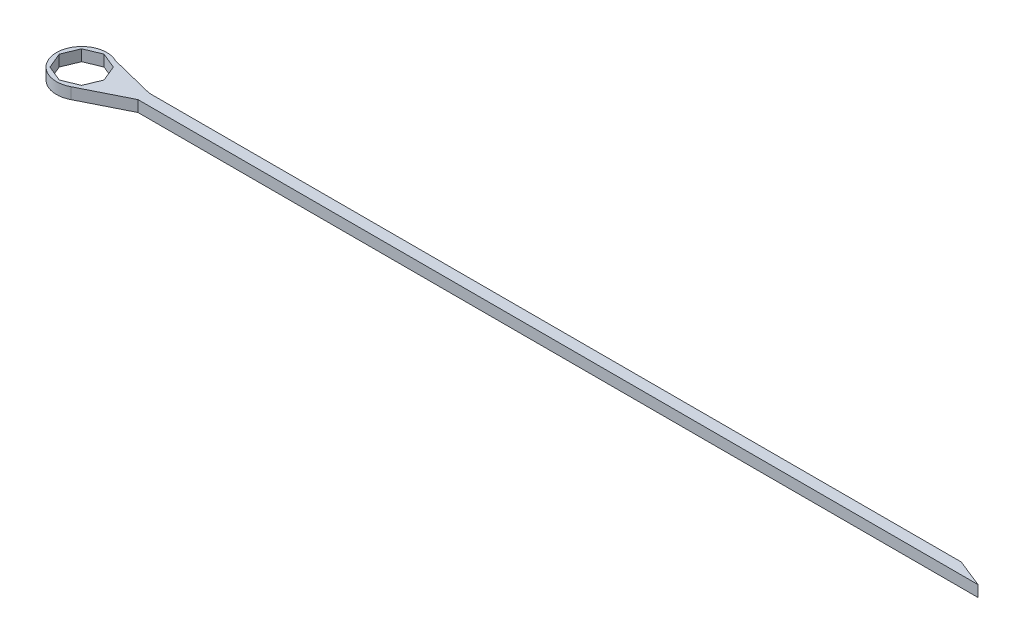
ISO-10303-21;
HEADER;
FILE_DESCRIPTION(('STEP AP214'),'2;1');
FILE_NAME('part.step','',(''),(''),'','','');
FILE_SCHEMA(('AUTOMOTIVE_DESIGN { 1 0 10303 214 1 1 1 1 }'));
ENDSEC;
DATA;
#1=APPLICATION_CONTEXT('core data for automotive mechanical design processes');
#2=APPLICATION_PROTOCOL_DEFINITION('international standard','automotive_design',2000,#1);
#3=PRODUCT_CONTEXT('',#1,'mechanical');
#4=PRODUCT('Part','Part','',(#3));
#5=PRODUCT_RELATED_PRODUCT_CATEGORY('part','',(#4));
#6=PRODUCT_DEFINITION_FORMATION('','',#4);
#7=PRODUCT_DEFINITION_CONTEXT('part definition',#1,'design');
#8=PRODUCT_DEFINITION('design','',#6,#7);
#9=PRODUCT_DEFINITION_SHAPE('','',#8);
#10=(LENGTH_UNIT() NAMED_UNIT(*) SI_UNIT(.MILLI.,.METRE.));
#11=(NAMED_UNIT(*) PLANE_ANGLE_UNIT() SI_UNIT($,.RADIAN.));
#12=(NAMED_UNIT(*) SI_UNIT($,.STERADIAN.) SOLID_ANGLE_UNIT());
#13=UNCERTAINTY_MEASURE_WITH_UNIT(LENGTH_MEASURE(1.E-05),#10,'distance_accuracy_value','');
#14=(GEOMETRIC_REPRESENTATION_CONTEXT(3) GLOBAL_UNCERTAINTY_ASSIGNED_CONTEXT((#13)) GLOBAL_UNIT_ASSIGNED_CONTEXT((#10,
#11,#12)) REPRESENTATION_CONTEXT('',''));
#15=CARTESIAN_POINT('',(0.,0.,0.));
#16=DIRECTION('',(0.,0.,1.));
#17=DIRECTION('',(1.,0.,0.));
#18=AXIS2_PLACEMENT_3D('',#15,#16,#17);
#19=CARTESIAN_POINT('',(0.,1.,0.));
#20=DIRECTION('',(0.,1.,0.));
#21=DIRECTION('',(0.,0.,1.));
#22=AXIS2_PLACEMENT_3D('',#19,#20,#21);
#23=PLANE('',#22);
#24=DIRECTION('',(0.894427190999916,0.,-0.447213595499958));
#25=VECTOR('',#24,1.);
#26=CARTESIAN_POINT('',(5.03077640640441,1.,0.));
#27=LINE('',#26,#25);
#28=CARTESIAN_POINT('',(1.03077640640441,1.,2.));
#29=VERTEX_POINT('',#28);
#30=CARTESIAN_POINT('',(5.03077640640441,1.,0.));
#31=VERTEX_POINT('',#30);
#32=EDGE_CURVE('E198',#29,#31,#27,.T.);
#33=ORIENTED_EDGE('',*,*,#32,.T.);
#34=DIRECTION('',(1.,0.,0.));
#35=VECTOR('',#34,1.);
#36=CARTESIAN_POINT('',(5.03077640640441,1.,0.));
#37=LINE('',#36,#35);
#38=CARTESIAN_POINT('',(80.,1.,0.));
#39=VERTEX_POINT('',#38);
#40=EDGE_CURVE('E201',#31,#39,#37,.T.);
#41=ORIENTED_EDGE('',*,*,#40,.T.);
#42=DIRECTION('',(-0.928476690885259,0.,-0.371390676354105));
#43=VECTOR('',#42,1.);
#44=CARTESIAN_POINT('',(80.,1.,0.));
#45=LINE('',#44,#43);
#46=CARTESIAN_POINT('',(77.5,1.,-1.00000000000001));
#47=VERTEX_POINT('',#46);
#48=EDGE_CURVE('E204',#39,#47,#45,.T.);
#49=ORIENTED_EDGE('',*,*,#48,.T.);
#50=DIRECTION('',(-1.,0.,0.));
#51=VECTOR('',#50,1.);
#52=CARTESIAN_POINT('',(77.5,1.,-1.00000000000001));
#53=LINE('',#52,#51);
#54=CARTESIAN_POINT('',(5.03077640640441,1.,-0.999999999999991));
#55=VERTEX_POINT('',#54);
#56=EDGE_CURVE('E206',#47,#55,#53,.T.);
#57=ORIENTED_EDGE('',*,*,#56,.T.);
#58=DIRECTION('',(-0.970142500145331,0.,-0.242535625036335));
#59=VECTOR('',#58,1.);
#60=CARTESIAN_POINT('',(5.03077640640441,1.,-0.999999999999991));
#61=LINE('',#60,#59);
#62=CARTESIAN_POINT('',(1.03077640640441,1.,-2.));
#63=VERTEX_POINT('',#62);
#64=EDGE_CURVE('E208',#55,#63,#61,.T.);
#65=ORIENTED_EDGE('',*,*,#64,.T.);
#66=CARTESIAN_POINT('',(0.,1.,0.));
#67=DIRECTION('',(0.,1.,0.));
#68=DIRECTION('',(0.,0.,1.));
#69=AXIS2_PLACEMENT_3D('',#66,#67,#68);
#70=CIRCLE('',#69,2.25);
#71=EDGE_CURVE('E210',#63,#29,#70,.T.);
#72=ORIENTED_EDGE('',*,*,#71,.T.);
#73=EDGE_LOOP('',(#33,#41,#49,#57,#65,#72));
#74=FACE_BOUND('',#73,.T.);
#75=DIRECTION('',(-0.38268343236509,0.,-0.923879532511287));
#76=VECTOR('',#75,1.);
#77=CARTESIAN_POINT('',(2.,1.,0.));
#78=LINE('',#77,#76);
#79=CARTESIAN_POINT('',(2.,1.,0.));
#80=VERTEX_POINT('',#79);
#81=CARTESIAN_POINT('',(1.4142135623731,1.,-1.4142135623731));
#82=VERTEX_POINT('',#81);
#83=EDGE_CURVE('E141',#80,#82,#78,.T.);
#84=ORIENTED_EDGE('',*,*,#83,.F.);
#85=DIRECTION('',(0.382683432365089,0.,-0.923879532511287));
#86=VECTOR('',#85,1.);
#87=CARTESIAN_POINT('',(1.4142135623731,1.,1.41421356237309));
#88=LINE('',#87,#86);
#89=CARTESIAN_POINT('',(1.4142135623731,1.,1.41421356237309));
#90=VERTEX_POINT('',#89);
#91=EDGE_CURVE('E133',#90,#80,#88,.T.);
#92=ORIENTED_EDGE('',*,*,#91,.F.);
#93=DIRECTION('',(0.923879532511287,0.,-0.38268343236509));
#94=VECTOR('',#93,1.);
#95=CARTESIAN_POINT('',(0.,1.,2.));
#96=LINE('',#95,#94);
#97=CARTESIAN_POINT('',(0.,1.,2.));
#98=VERTEX_POINT('',#97);
#99=EDGE_CURVE('E166',#98,#90,#96,.T.);
#100=ORIENTED_EDGE('',*,*,#99,.F.);
#101=DIRECTION('',(0.923879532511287,0.,0.382683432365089));
#102=VECTOR('',#101,1.);
#103=CARTESIAN_POINT('',(-1.41421356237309,1.,1.4142135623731));
#104=LINE('',#103,#102);
#105=CARTESIAN_POINT('',(-1.41421356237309,1.,1.4142135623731));
#106=VERTEX_POINT('',#105);
#107=EDGE_CURVE('E164',#106,#98,#104,.T.);
#108=ORIENTED_EDGE('',*,*,#107,.F.);
#109=DIRECTION('',(0.38268343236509,0.,0.923879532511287));
#110=VECTOR('',#109,1.);
#111=CARTESIAN_POINT('',(-2.,1.,0.));
#112=LINE('',#111,#110);
#113=CARTESIAN_POINT('',(-2.,1.,0.));
#114=VERTEX_POINT('',#113);
#115=EDGE_CURVE('E162',#114,#106,#112,.T.);
#116=ORIENTED_EDGE('',*,*,#115,.F.);
#117=DIRECTION('',(-0.382683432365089,0.,0.923879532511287));
#118=VECTOR('',#117,1.);
#119=CARTESIAN_POINT('',(-1.4142135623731,1.,-1.4142135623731));
#120=LINE('',#119,#118);
#121=CARTESIAN_POINT('',(-1.4142135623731,1.,-1.4142135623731));
#122=VERTEX_POINT('',#121);
#123=EDGE_CURVE('E160',#122,#114,#120,.T.);
#124=ORIENTED_EDGE('',*,*,#123,.F.);
#125=DIRECTION('',(-0.923879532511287,0.,0.38268343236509));
#126=VECTOR('',#125,1.);
#127=CARTESIAN_POINT('',(0.,1.,-2.));
#128=LINE('',#127,#126);
#129=CARTESIAN_POINT('',(0.,1.,-2.));
#130=VERTEX_POINT('',#129);
#131=EDGE_CURVE('E156',#130,#122,#128,.T.);
#132=ORIENTED_EDGE('',*,*,#131,.F.);
#133=DIRECTION('',(-0.923879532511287,0.,-0.38268343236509));
#134=VECTOR('',#133,1.);
#135=CARTESIAN_POINT('',(1.4142135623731,1.,-1.4142135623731));
#136=LINE('',#135,#134);
#137=EDGE_CURVE('E154',#82,#130,#136,.T.);
#138=ORIENTED_EDGE('',*,*,#137,.F.);
#139=EDGE_LOOP('',(#84,#92,#100,#108,#116,#124,#132,#138));
#140=FACE_BOUND('',#139,.T.);
#141=ADVANCED_FACE('F32',(#74,#140),#23,.T.);
#142=CARTESIAN_POINT('',(0.,0.,0.));
#143=DIRECTION('',(0.,1.,0.));
#144=DIRECTION('',(0.,0.,1.));
#145=AXIS2_PLACEMENT_3D('',#142,#143,#144);
#146=PLANE('',#145);
#147=DIRECTION('',(0.894427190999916,0.,-0.447213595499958));
#148=VECTOR('',#147,1.);
#149=CARTESIAN_POINT('',(5.03077640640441,0.,0.));
#150=LINE('',#149,#148);
#151=CARTESIAN_POINT('',(1.03077640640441,0.,2.));
#152=VERTEX_POINT('',#151);
#153=CARTESIAN_POINT('',(5.03077640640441,0.,0.));
#154=VERTEX_POINT('',#153);
#155=EDGE_CURVE('E149',#152,#154,#150,.T.);
#156=ORIENTED_EDGE('',*,*,#155,.F.);
#157=CARTESIAN_POINT('',(0.,0.,0.));
#158=DIRECTION('',(0.,1.,0.));
#159=DIRECTION('',(0.,0.,1.));
#160=AXIS2_PLACEMENT_3D('',#157,#158,#159);
#161=CIRCLE('',#160,2.25);
#162=CARTESIAN_POINT('',(1.03077640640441,0.,-2.));
#163=VERTEX_POINT('',#162);
#164=EDGE_CURVE('E202',#163,#152,#161,.T.);
#165=ORIENTED_EDGE('',*,*,#164,.F.);
#166=DIRECTION('',(-0.970142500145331,0.,-0.242535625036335));
#167=VECTOR('',#166,1.);
#168=CARTESIAN_POINT('',(5.03077640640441,0.,-0.999999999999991));
#169=LINE('',#168,#167);
#170=CARTESIAN_POINT('',(5.03077640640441,0.,-0.999999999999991));
#171=VERTEX_POINT('',#170);
#172=EDGE_CURVE('E221',#171,#163,#169,.T.);
#173=ORIENTED_EDGE('',*,*,#172,.F.);
#174=DIRECTION('',(-1.,0.,0.));
#175=VECTOR('',#174,1.);
#176=CARTESIAN_POINT('',(77.5,0.,-1.00000000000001));
#177=LINE('',#176,#175);
#178=CARTESIAN_POINT('',(77.5,0.,-1.00000000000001));
#179=VERTEX_POINT('',#178);
#180=EDGE_CURVE('E219',#179,#171,#177,.T.);
#181=ORIENTED_EDGE('',*,*,#180,.F.);
#182=DIRECTION('',(-0.928476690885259,0.,-0.371390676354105));
#183=VECTOR('',#182,1.);
#184=CARTESIAN_POINT('',(80.,0.,0.));
#185=LINE('',#184,#183);
#186=CARTESIAN_POINT('',(80.,0.,0.));
#187=VERTEX_POINT('',#186);
#188=EDGE_CURVE('E217',#187,#179,#185,.T.);
#189=ORIENTED_EDGE('',*,*,#188,.F.);
#190=DIRECTION('',(1.,0.,0.));
#191=VECTOR('',#190,1.);
#192=CARTESIAN_POINT('',(5.03077640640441,0.,0.));
#193=LINE('',#192,#191);
#194=EDGE_CURVE('E215',#154,#187,#193,.T.);
#195=ORIENTED_EDGE('',*,*,#194,.F.);
#196=EDGE_LOOP('',(#156,#165,#173,#181,#189,#195));
#197=FACE_BOUND('',#196,.T.);
#198=DIRECTION('',(0.382683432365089,0.,-0.923879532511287));
#199=VECTOR('',#198,1.);
#200=CARTESIAN_POINT('',(1.4142135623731,0.,1.41421356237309));
#201=LINE('',#200,#199);
#202=CARTESIAN_POINT('',(1.4142135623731,0.,1.41421356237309));
#203=VERTEX_POINT('',#202);
#204=CARTESIAN_POINT('',(2.,0.,0.));
#205=VERTEX_POINT('',#204);
#206=EDGE_CURVE('E55',#203,#205,#201,.T.);
#207=ORIENTED_EDGE('',*,*,#206,.T.);
#208=DIRECTION('',(-0.38268343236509,0.,-0.923879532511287));
#209=VECTOR('',#208,1.);
#210=CARTESIAN_POINT('',(2.,0.,0.));
#211=LINE('',#210,#209);
#212=CARTESIAN_POINT('',(1.4142135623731,0.,-1.4142135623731));
#213=VERTEX_POINT('',#212);
#214=EDGE_CURVE('E148',#205,#213,#211,.T.);
#215=ORIENTED_EDGE('',*,*,#214,.T.);
#216=DIRECTION('',(-0.923879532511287,0.,-0.38268343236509));
#217=VECTOR('',#216,1.);
#218=CARTESIAN_POINT('',(1.4142135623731,0.,-1.4142135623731));
#219=LINE('',#218,#217);
#220=CARTESIAN_POINT('',(0.,0.,-2.));
#221=VERTEX_POINT('',#220);
#222=EDGE_CURVE('E170',#213,#221,#219,.T.);
#223=ORIENTED_EDGE('',*,*,#222,.T.);
#224=DIRECTION('',(-0.923879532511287,0.,0.38268343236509));
#225=VECTOR('',#224,1.);
#226=CARTESIAN_POINT('',(0.,0.,-2.));
#227=LINE('',#226,#225);
#228=CARTESIAN_POINT('',(-1.4142135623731,0.,-1.4142135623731));
#229=VERTEX_POINT('',#228);
#230=EDGE_CURVE('E173',#221,#229,#227,.T.);
#231=ORIENTED_EDGE('',*,*,#230,.T.);
#232=DIRECTION('',(-0.382683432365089,0.,0.923879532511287));
#233=VECTOR('',#232,1.);
#234=CARTESIAN_POINT('',(-1.4142135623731,0.,-1.4142135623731));
#235=LINE('',#234,#233);
#236=CARTESIAN_POINT('',(-2.,0.,0.));
#237=VERTEX_POINT('',#236);
#238=EDGE_CURVE('E176',#229,#237,#235,.T.);
#239=ORIENTED_EDGE('',*,*,#238,.T.);
#240=DIRECTION('',(0.38268343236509,0.,0.923879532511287));
#241=VECTOR('',#240,1.);
#242=CARTESIAN_POINT('',(-2.,0.,0.));
#243=LINE('',#242,#241);
#244=CARTESIAN_POINT('',(-1.41421356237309,0.,1.4142135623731));
#245=VERTEX_POINT('',#244);
#246=EDGE_CURVE('E179',#237,#245,#243,.T.);
#247=ORIENTED_EDGE('',*,*,#246,.T.);
#248=DIRECTION('',(0.923879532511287,0.,0.382683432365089));
#249=VECTOR('',#248,1.);
#250=CARTESIAN_POINT('',(-1.41421356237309,0.,1.4142135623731));
#251=LINE('',#250,#249);
#252=CARTESIAN_POINT('',(0.,0.,2.));
#253=VERTEX_POINT('',#252);
#254=EDGE_CURVE('E182',#245,#253,#251,.T.);
#255=ORIENTED_EDGE('',*,*,#254,.T.);
#256=DIRECTION('',(0.923879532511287,0.,-0.38268343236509));
#257=VECTOR('',#256,1.);
#258=CARTESIAN_POINT('',(0.,0.,2.));
#259=LINE('',#258,#257);
#260=EDGE_CURVE('E142',#253,#203,#259,.T.);
#261=ORIENTED_EDGE('',*,*,#260,.T.);
#262=EDGE_LOOP('',(#207,#215,#223,#231,#239,#247,#255,#261));
#263=FACE_BOUND('',#262,.T.);
#264=ADVANCED_FACE('F245',(#197,#263),#146,.F.);
#265=CARTESIAN_POINT('',(5.03077640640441,1.,0.));
#266=DIRECTION('',(-0.447213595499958,0.,-0.894427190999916));
#267=DIRECTION('',(-0.894427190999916,0.,0.447213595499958));
#268=AXIS2_PLACEMENT_3D('',#265,#266,#267);
#269=PLANE('',#268);
#270=ORIENTED_EDGE('',*,*,#155,.T.);
#271=DIRECTION('',(0.,-1.,0.));
#272=VECTOR('',#271,1.);
#273=CARTESIAN_POINT('',(5.03077640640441,1.,0.));
#274=LINE('',#273,#272);
#275=EDGE_CURVE('E11',#31,#154,#274,.T.);
#276=ORIENTED_EDGE('',*,*,#275,.F.);
#277=ORIENTED_EDGE('',*,*,#32,.F.);
#278=DIRECTION('',(0.,-1.,0.));
#279=VECTOR('',#278,1.);
#280=CARTESIAN_POINT('',(1.03077640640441,1.,2.));
#281=LINE('',#280,#279);
#282=EDGE_CURVE('E212',#29,#152,#281,.T.);
#283=ORIENTED_EDGE('',*,*,#282,.T.);
#284=EDGE_LOOP('',(#270,#276,#277,#283));
#285=FACE_BOUND('',#284,.T.);
#286=ADVANCED_FACE('F34',(#285),#269,.F.);
#287=CARTESIAN_POINT('',(5.03077640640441,1.,0.));
#288=DIRECTION('',(0.,0.,-1.));
#289=DIRECTION('',(-1.,0.,0.));
#290=AXIS2_PLACEMENT_3D('',#287,#288,#289);
#291=PLANE('',#290);
#292=ORIENTED_EDGE('',*,*,#194,.T.);
#293=DIRECTION('',(0.,-1.,0.));
#294=VECTOR('',#293,1.);
#295=CARTESIAN_POINT('',(80.,1.,0.));
#296=LINE('',#295,#294);
#297=EDGE_CURVE('E40',#39,#187,#296,.T.);
#298=ORIENTED_EDGE('',*,*,#297,.F.);
#299=ORIENTED_EDGE('',*,*,#40,.F.);
#300=ORIENTED_EDGE('',*,*,#275,.T.);
#301=EDGE_LOOP('',(#292,#298,#299,#300));
#302=FACE_BOUND('',#301,.T.);
#303=ADVANCED_FACE('F262',(#302),#291,.F.);
#304=CARTESIAN_POINT('',(80.,1.,0.));
#305=DIRECTION('',(-0.371390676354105,0.,0.928476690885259));
#306=DIRECTION('',(0.928476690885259,0.,0.371390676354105));
#307=AXIS2_PLACEMENT_3D('',#304,#305,#306);
#308=PLANE('',#307);
#309=ORIENTED_EDGE('',*,*,#188,.T.);
#310=DIRECTION('',(0.,-1.,0.));
#311=VECTOR('',#310,1.);
#312=CARTESIAN_POINT('',(77.5,1.,-1.00000000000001));
#313=LINE('',#312,#311);
#314=EDGE_CURVE('E232',#47,#179,#313,.T.);
#315=ORIENTED_EDGE('',*,*,#314,.F.);
#316=ORIENTED_EDGE('',*,*,#48,.F.);
#317=ORIENTED_EDGE('',*,*,#297,.T.);
#318=EDGE_LOOP('',(#309,#315,#316,#317));
#319=FACE_BOUND('',#318,.T.);
#320=ADVANCED_FACE('F239',(#319),#308,.F.);
#321=CARTESIAN_POINT('',(77.5,1.,-1.00000000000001));
#322=DIRECTION('',(0.,0.,1.));
#323=DIRECTION('',(1.,0.,0.));
#324=AXIS2_PLACEMENT_3D('',#321,#322,#323);
#325=PLANE('',#324);
#326=ORIENTED_EDGE('',*,*,#180,.T.);
#327=DIRECTION('',(0.,-1.,0.));
#328=VECTOR('',#327,1.);
#329=CARTESIAN_POINT('',(5.03077640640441,1.,-0.999999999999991));
#330=LINE('',#329,#328);
#331=EDGE_CURVE('E229',#55,#171,#330,.T.);
#332=ORIENTED_EDGE('',*,*,#331,.F.);
#333=ORIENTED_EDGE('',*,*,#56,.F.);
#334=ORIENTED_EDGE('',*,*,#314,.T.);
#335=EDGE_LOOP('',(#326,#332,#333,#334));
#336=FACE_BOUND('',#335,.T.);
#337=ADVANCED_FACE('F251',(#336),#325,.F.);
#338=CARTESIAN_POINT('',(5.03077640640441,1.,-0.999999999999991));
#339=DIRECTION('',(-0.242535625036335,0.,0.970142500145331));
#340=DIRECTION('',(0.970142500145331,0.,0.242535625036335));
#341=AXIS2_PLACEMENT_3D('',#338,#339,#340);
#342=PLANE('',#341);
#343=ORIENTED_EDGE('',*,*,#172,.T.);
#344=DIRECTION('',(0.,-1.,0.));
#345=VECTOR('',#344,1.);
#346=CARTESIAN_POINT('',(1.03077640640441,1.,-2.));
#347=LINE('',#346,#345);
#348=EDGE_CURVE('E226',#63,#163,#347,.T.);
#349=ORIENTED_EDGE('',*,*,#348,.F.);
#350=ORIENTED_EDGE('',*,*,#64,.F.);
#351=ORIENTED_EDGE('',*,*,#331,.T.);
#352=EDGE_LOOP('',(#343,#349,#350,#351));
#353=FACE_BOUND('',#352,.T.);
#354=ADVANCED_FACE('F255',(#353),#342,.F.);
#355=CARTESIAN_POINT('',(0.,1.,0.));
#356=DIRECTION('',(0.,-1.,0.));
#357=DIRECTION('',(0.,0.,-1.));
#358=AXIS2_PLACEMENT_3D('',#355,#356,#357);
#359=CYLINDRICAL_SURFACE('',#358,2.25);
#360=ORIENTED_EDGE('',*,*,#164,.T.);
#361=ORIENTED_EDGE('',*,*,#282,.F.);
#362=ORIENTED_EDGE('',*,*,#71,.F.);
#363=ORIENTED_EDGE('',*,*,#348,.T.);
#364=EDGE_LOOP('',(#360,#361,#362,#363));
#365=FACE_BOUND('',#364,.T.);
#366=ADVANCED_FACE('F265',(#365),#359,.T.);
#367=CARTESIAN_POINT('',(1.4142135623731,1.,1.41421356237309));
#368=DIRECTION('',(-0.923879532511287,0.,-0.38268343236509));
#369=DIRECTION('',(-0.38268343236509,0.,0.923879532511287));
#370=AXIS2_PLACEMENT_3D('',#367,#368,#369);
#371=PLANE('',#370);
#372=ORIENTED_EDGE('',*,*,#206,.F.);
#373=DIRECTION('',(0.,-1.,0.));
#374=VECTOR('',#373,1.);
#375=CARTESIAN_POINT('',(1.4142135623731,1.,1.41421356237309));
#376=LINE('',#375,#374);
#377=EDGE_CURVE('E137',#90,#203,#376,.T.);
#378=ORIENTED_EDGE('',*,*,#377,.F.);
#379=ORIENTED_EDGE('',*,*,#91,.T.);
#380=DIRECTION('',(0.,-1.,0.));
#381=VECTOR('',#380,1.);
#382=CARTESIAN_POINT('',(2.,1.,0.));
#383=LINE('',#382,#381);
#384=EDGE_CURVE('E136',#80,#205,#383,.T.);
#385=ORIENTED_EDGE('',*,*,#384,.T.);
#386=EDGE_LOOP('',(#372,#378,#379,#385));
#387=FACE_BOUND('',#386,.T.);
#388=ADVANCED_FACE('F135',(#387),#371,.T.);
#389=CARTESIAN_POINT('',(2.,1.,0.));
#390=DIRECTION('',(-0.923879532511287,0.,0.38268343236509));
#391=DIRECTION('',(0.38268343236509,0.,0.923879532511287));
#392=AXIS2_PLACEMENT_3D('',#389,#390,#391);
#393=PLANE('',#392);
#394=ORIENTED_EDGE('',*,*,#214,.F.);
#395=ORIENTED_EDGE('',*,*,#384,.F.);
#396=ORIENTED_EDGE('',*,*,#83,.T.);
#397=DIRECTION('',(0.,-1.,0.));
#398=VECTOR('',#397,1.);
#399=CARTESIAN_POINT('',(1.4142135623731,1.,-1.4142135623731));
#400=LINE('',#399,#398);
#401=EDGE_CURVE('E150',#82,#213,#400,.T.);
#402=ORIENTED_EDGE('',*,*,#401,.T.);
#403=EDGE_LOOP('',(#394,#395,#396,#402));
#404=FACE_BOUND('',#403,.T.);
#405=ADVANCED_FACE('F145',(#404),#393,.T.);
#406=CARTESIAN_POINT('',(1.4142135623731,1.,-1.4142135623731));
#407=DIRECTION('',(-0.38268343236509,0.,0.923879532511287));
#408=DIRECTION('',(0.923879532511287,0.,0.38268343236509));
#409=AXIS2_PLACEMENT_3D('',#406,#407,#408);
#410=PLANE('',#409);
#411=ORIENTED_EDGE('',*,*,#222,.F.);
#412=ORIENTED_EDGE('',*,*,#401,.F.);
#413=ORIENTED_EDGE('',*,*,#137,.T.);
#414=DIRECTION('',(0.,-1.,0.));
#415=VECTOR('',#414,1.);
#416=CARTESIAN_POINT('',(0.,1.,-2.));
#417=LINE('',#416,#415);
#418=EDGE_CURVE('E195',#130,#221,#417,.T.);
#419=ORIENTED_EDGE('',*,*,#418,.T.);
#420=EDGE_LOOP('',(#411,#412,#413,#419));
#421=FACE_BOUND('',#420,.T.);
#422=ADVANCED_FACE('F283',(#421),#410,.T.);
#423=CARTESIAN_POINT('',(0.,1.,-2.));
#424=DIRECTION('',(0.38268343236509,0.,0.923879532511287));
#425=DIRECTION('',(0.923879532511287,0.,-0.38268343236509));
#426=AXIS2_PLACEMENT_3D('',#423,#424,#425);
#427=PLANE('',#426);
#428=ORIENTED_EDGE('',*,*,#230,.F.);
#429=ORIENTED_EDGE('',*,*,#418,.F.);
#430=ORIENTED_EDGE('',*,*,#131,.T.);
#431=DIRECTION('',(0.,-1.,0.));
#432=VECTOR('',#431,1.);
#433=CARTESIAN_POINT('',(-1.4142135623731,1.,-1.4142135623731));
#434=LINE('',#433,#432);
#435=EDGE_CURVE('E193',#122,#229,#434,.T.);
#436=ORIENTED_EDGE('',*,*,#435,.T.);
#437=EDGE_LOOP('',(#428,#429,#430,#436));
#438=FACE_BOUND('',#437,.T.);
#439=ADVANCED_FACE('F286',(#438),#427,.T.);
#440=CARTESIAN_POINT('',(-1.4142135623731,1.,-1.4142135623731));
#441=DIRECTION('',(0.923879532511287,0.,0.382683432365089));
#442=DIRECTION('',(0.382683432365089,0.,-0.923879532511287));
#443=AXIS2_PLACEMENT_3D('',#440,#441,#442);
#444=PLANE('',#443);
#445=ORIENTED_EDGE('',*,*,#238,.F.);
#446=ORIENTED_EDGE('',*,*,#435,.F.);
#447=ORIENTED_EDGE('',*,*,#123,.T.);
#448=DIRECTION('',(0.,-1.,0.));
#449=VECTOR('',#448,1.);
#450=CARTESIAN_POINT('',(-2.,1.,0.));
#451=LINE('',#450,#449);
#452=EDGE_CURVE('E191',#114,#237,#451,.T.);
#453=ORIENTED_EDGE('',*,*,#452,.T.);
#454=EDGE_LOOP('',(#445,#446,#447,#453));
#455=FACE_BOUND('',#454,.T.);
#456=ADVANCED_FACE('F290',(#455),#444,.T.);
#457=CARTESIAN_POINT('',(-2.,1.,0.));
#458=DIRECTION('',(0.923879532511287,0.,-0.38268343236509));
#459=DIRECTION('',(-0.38268343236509,0.,-0.923879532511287));
#460=AXIS2_PLACEMENT_3D('',#457,#458,#459);
#461=PLANE('',#460);
#462=ORIENTED_EDGE('',*,*,#246,.F.);
#463=ORIENTED_EDGE('',*,*,#452,.F.);
#464=ORIENTED_EDGE('',*,*,#115,.T.);
#465=DIRECTION('',(0.,-1.,0.));
#466=VECTOR('',#465,1.);
#467=CARTESIAN_POINT('',(-1.41421356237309,1.,1.4142135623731));
#468=LINE('',#467,#466);
#469=EDGE_CURVE('E189',#106,#245,#468,.T.);
#470=ORIENTED_EDGE('',*,*,#469,.T.);
#471=EDGE_LOOP('',(#462,#463,#464,#470));
#472=FACE_BOUND('',#471,.T.);
#473=ADVANCED_FACE('F294',(#472),#461,.T.);
#474=CARTESIAN_POINT('',(-1.41421356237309,1.,1.4142135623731));
#475=DIRECTION('',(0.382683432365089,0.,-0.923879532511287));
#476=DIRECTION('',(-0.923879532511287,0.,-0.382683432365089));
#477=AXIS2_PLACEMENT_3D('',#474,#475,#476);
#478=PLANE('',#477);
#479=ORIENTED_EDGE('',*,*,#254,.F.);
#480=ORIENTED_EDGE('',*,*,#469,.F.);
#481=ORIENTED_EDGE('',*,*,#107,.T.);
#482=DIRECTION('',(0.,-1.,0.));
#483=VECTOR('',#482,1.);
#484=CARTESIAN_POINT('',(0.,1.,2.));
#485=LINE('',#484,#483);
#486=EDGE_CURVE('E47',#98,#253,#485,.T.);
#487=ORIENTED_EDGE('',*,*,#486,.T.);
#488=EDGE_LOOP('',(#479,#480,#481,#487));
#489=FACE_BOUND('',#488,.T.);
#490=ADVANCED_FACE('F298',(#489),#478,.T.);
#491=CARTESIAN_POINT('',(0.,1.,2.));
#492=DIRECTION('',(-0.38268343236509,0.,-0.923879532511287));
#493=DIRECTION('',(-0.923879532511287,0.,0.38268343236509));
#494=AXIS2_PLACEMENT_3D('',#491,#492,#493);
#495=PLANE('',#494);
#496=ORIENTED_EDGE('',*,*,#260,.F.);
#497=ORIENTED_EDGE('',*,*,#486,.F.);
#498=ORIENTED_EDGE('',*,*,#99,.T.);
#499=ORIENTED_EDGE('',*,*,#377,.T.);
#500=EDGE_LOOP('',(#496,#497,#498,#499));
#501=FACE_BOUND('',#500,.T.);
#502=ADVANCED_FACE('F302',(#501),#495,.T.);
#503=CLOSED_SHELL('',(#141,#264,#286,#303,#320,#337,#354,#366,#388,#405,#422,#439,#456,#473,
#490,#502));
#504=MANIFOLD_SOLID_BREP('B2',#503);
#505=ADVANCED_BREP_SHAPE_REPRESENTATION('',(#18,#504),#14);
#506=SHAPE_DEFINITION_REPRESENTATION(#9,#505);
ENDSEC;
END-ISO-10303-21;
